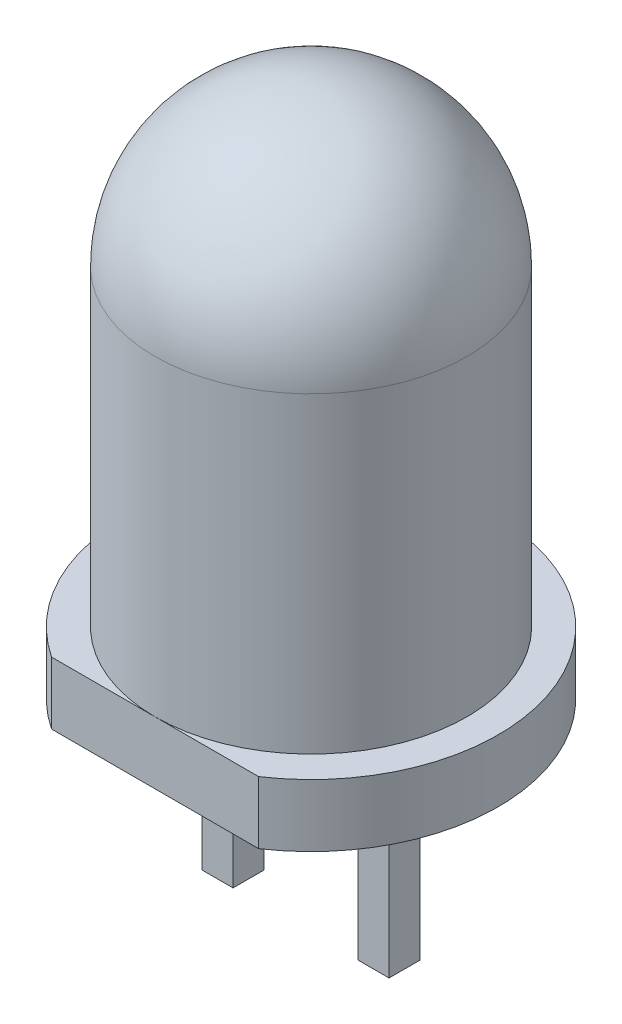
from build123d import *

# Parameters (mm, degrees)
BOSS_EXTRUDE1_DEPTH = 1
SKETCH2_R           = 2.5
BOSS_EXTRUDE2_DEPTH = 5
DOME1_FACE_RADIUS   = 2.5
DOME1_HEIGHT        = 2.5
SKETCH3_W           = 0.5
SKETCH3_H           = 0.5
BOSS_EXTRUDE3_DEPTH = 3


with BuildPart() as part:
    # Sketch1 → Boss-Extrude1 (new body)
    with BuildSketch(Plane(origin=(0, 0, 0), x_dir=(1, 0, 0), z_dir=(0, 1, 0))):
        with BuildLine():
            Line((-1.658312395, -2.5), (1.658312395, -2.5))
            ThreePointArc((1.658312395, -2.5), (0, 3), (-1.658312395, -2.5))
        make_face()
    extrude(amount=BOSS_EXTRUDE1_DEPTH)

    # Sketch2 → Boss-Extrude2 (add)
    with BuildSketch(Plane(origin=(0, 1, 0), x_dir=(1, 0, 0), z_dir=(0, 1, 0))):
        with Locations(Location((0, 0, 0), (0, 0, 270))):
            Circle(SKETCH2_R)
    extrude(amount=BOSS_EXTRUDE2_DEPTH)

    # Dome1: a dome of height H over a round flat face of radius A is a cap of a sphere of radius (A * A + H * H) / (2 * H)
    dome1_r = (DOME1_FACE_RADIUS * DOME1_FACE_RADIUS + DOME1_HEIGHT * DOME1_HEIGHT) / (2 * DOME1_HEIGHT)
    dome1_base = Plane((0, 6, 0), z_dir=(0, 1, 0))
    with Locations(dome1_base.offset(DOME1_HEIGHT - dome1_r)):
        dome1_ball = Sphere(dome1_r, mode=Mode.PRIVATE)
    add(split(dome1_ball, bisect_by=dome1_base, keep=Keep.TOP, mode=Mode.PRIVATE))

    # Sketch3 → Boss-Extrude3 (add)
    with BuildSketch(Plane.XZ):
        with Locations((-1.25, 0)):
            Rectangle(SKETCH3_W, SKETCH3_H)
        with Locations((1.25, 0)):
            Rectangle(SKETCH3_W, SKETCH3_H)
    extrude(amount=BOSS_EXTRUDE3_DEPTH)


solid = part.part
